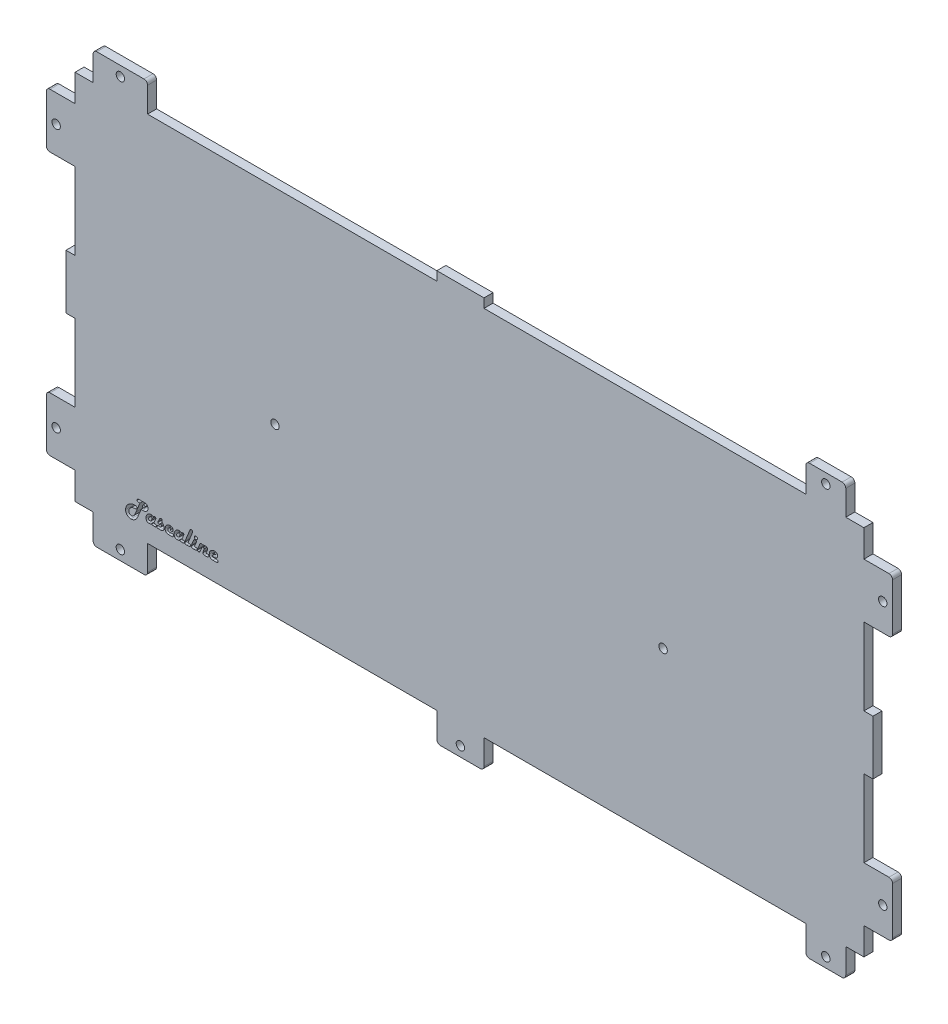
from build123d import *

# Parameters (mm, degrees)
SKETCH1_W                 = 276.225
SKETCH1_H                 = 130.175
BOSS_EXTRUDE1_DEPTH       = 3.175
SKETCH2_W                 = 16.51
SKETCH2_H                 = 3.175
SKETCH2_W_2               = 10.033
SKETCH2_H_2               = 19.05
SKETCH2_W_3               = 3.175
SKETCH2_W_4               = 19.05
SKETCH2_H_3               = 10.033
SKETCH2_W_5               = 13.97
BOSS_EXTRUDE2_DEPTH       = 3.175
F_4_CLEARANCE_HOLE1_D     = 2.9464
F_4_CLEARANCE_HOLE1_DEPTH = 3.302
FILLET1_R                 = 1.27
CUT_EXTRUDE1_DEPTH        = 319.76638225


with BuildPart() as part:
    # Sketch1 → Boss-Extrude1 (new body)
    with BuildSketch(Plane.XY):
        with Locations((138.1125, 65.0875)):
            Rectangle(SKETCH1_W, SKETCH1_H)
    extrude(amount=BOSS_EXTRUDE1_DEPTH)

    # Sketch2 → Boss-Extrude2 (add)
    with BuildSketch(Plane.XY):
        with Locations((134.9375, 131.7625)):
            Rectangle(SKETCH2_W, SKETCH2_H)
        with Locations((281.2415, 19.05)):
            Rectangle(SKETCH2_W_2, SKETCH2_H_2)
        with Locations((281.2415, 111.125)):
            Rectangle(SKETCH2_W_2, SKETCH2_H_2)
        with Locations((277.8125, 65.0875)):
            Rectangle(SKETCH2_W_3, SKETCH2_H_2)
        with Locations((-5.0165, 19.05)):
            Rectangle(SKETCH2_W_2, SKETCH2_H_2)
        with Locations((-1.5875, 65.0875)):
            Rectangle(SKETCH2_W_3, SKETCH2_H_2)
        with Locations((-5.0165, 111.125)):
            Rectangle(SKETCH2_W_2, SKETCH2_H_2)
        with Locations((15.875, -5.0165)):
            Rectangle(SKETCH2_W_4, SKETCH2_H_3)
        with Locations((134.9375, -5.0165)):
            Rectangle(SKETCH2_W, SKETCH2_H_3)
        with Locations((262.89, -5.0165)):
            Rectangle(SKETCH2_W_5, SKETCH2_H_3)
        with Locations((15.875, 135.1915)):
            Rectangle(SKETCH2_W_4, SKETCH2_H_3)
        with Locations((262.89, 135.1915)):
            Rectangle(SKETCH2_W_5, SKETCH2_H_3)
    extrude(amount=BOSS_EXTRUDE2_DEPTH)

    # 4 Clearance Hole1
    with Locations(Plane.XY.offset(3.175)):
        with Locations((70.013924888, 58.42), (205.903924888, 58.42), (134.9375, -6.604), (15.875, -6.604), (262.89, -6.604), (262.89, 136.779), (15.875, 136.779), (282.829, 111.125), (282.829, 19.05), (-6.604, 111.125), (-6.604, 19.05)):
            Hole(F_4_CLEARANCE_HOLE1_D / 2, depth=F_4_CLEARANCE_HOLE1_DEPTH)

    # Fillet1
    fillet1_edges = [part.edges().sort_by_distance(p)[0] for p in [
        (6.35, 140.208, 1.5875),
        (25.4, 140.208, 1.5875),
        (255.905, 140.208, 1.5875),
        (269.875, 140.208, 1.5875),
        (269.875, -10.033, 1.5875),
        (255.905, -10.033, 1.5875),
        (143.1925, -10.033, 1.5875),
        (126.6825, -10.033, 1.5875),
        (25.4, -10.033, 1.5875),
        (6.35, -10.033, 1.5875),
        (-10.033, 120.65, 1.5875),
        (-10.033, 28.575, 1.5875),
        (-10.033, 101.6, 1.5875),
        (-10.033, 9.525, 1.5875),
        (286.258, 120.65, 1.5875),
        (286.258, 101.6, 1.5875),
        (286.258, 28.575, 1.5875),
        (286.258, 9.525, 1.5875),
    ]]
    fillet(fillet1_edges, radius=FILLET1_R)

    # Sketch6 → Cut-Extrude1 (cut, through all)
    # profile 1 of 10: a face of its own
    with BuildSketch(Plane.XY.offset(3.175)):
        with BuildLine():
            Line((23.119201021, 9.164609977), (22.451206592, 7.500566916))
            add(Edge.make_bspline(
                [(22.451206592, 7.500566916), (22.411003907, 7.401430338), (22.333829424, 7.211124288), (22.219435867, 6.938643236), (22.112680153, 6.690113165), (22.012786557, 6.465475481), (21.920717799, 6.264069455), (21.833533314, 6.087517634), (21.755963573, 5.933870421), (21.661354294, 5.762755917), (21.539114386, 5.572432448), (21.375027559, 5.364837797), (21.194459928, 5.172753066), (21.060129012, 5.059889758), (20.992791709, 5.003313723)],
                knots=[0, 0, 0, 0, 1.315970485, 2.526183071, 3.635244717, 4.643279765, 5.550454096, 6.359128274, 7.065363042, 7.667512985, 8.763908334, 9.843272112, 10.918877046, 12, 12, 12, 12], degree=3))
            add(Edge.make_bspline(
                [(20.992791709, 5.003313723), (20.941866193, 4.965231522), (20.841070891, 4.889856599), (20.680401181, 4.792052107), (20.514563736, 4.708473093), (20.341573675, 4.641675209), (20.163005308, 4.589417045), (19.978244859, 4.551262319), (19.787353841, 4.528037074), (19.658056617, 4.52556047), (19.592618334, 4.524307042)],
                knots=[0, 0, 0, 0, 1.011044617, 2.001129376, 2.987597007, 3.961339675, 4.946518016, 5.943976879, 6.959431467, 8, 8, 8, 8], degree=3))
            add(Edge.make_bspline(
                [(19.592618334, 4.524307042), (19.523985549, 4.52577862), (19.389812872, 4.52865546), (19.193870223, 4.554855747), (19.007122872, 4.594062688), (18.83078106, 4.653339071), (18.663334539, 4.726507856), (18.506601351, 4.817898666), (18.35966799, 4.925082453), (18.22480845, 5.048815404), (18.102569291, 5.184697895), (17.996369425, 5.332046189), (17.904994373, 5.488467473), (17.831448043, 5.655681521), (17.774055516, 5.832504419), (17.734367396, 6.018966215), (17.708307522, 6.214954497), (17.70541107, 6.3491208), (17.70392946, 6.417750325)],
                knots=[0, 0, 0, 0, 1.095039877, 2.140732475, 3.150521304, 4.13652018, 5.104897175, 6.062745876, 7.026672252, 8.00261995, 8.979018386, 9.939223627, 10.897072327, 11.865449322, 12.849478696, 13.859267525, 14.904960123, 16, 16, 16, 16], degree=3))
            add(Edge.make_bspline(
                [(17.70392946, 6.417750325), (17.706469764, 6.510196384), (17.711485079, 6.692712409), (17.750571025, 6.961954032), (17.814671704, 7.222484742), (17.905671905, 7.473969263), (18.021297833, 7.716830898), (18.16431112, 7.949570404), (18.332042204, 8.17426002), (18.460931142, 8.313119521), (18.526442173, 8.383698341)],
                knots=[0, 0, 0, 0, 1.01377589, 2.001495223, 2.977585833, 3.952291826, 4.930103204, 5.92294397, 6.944284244, 8, 8, 8, 8], degree=3))
            add(Edge.make_bspline(
                [(18.526442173, 8.383698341), (18.564038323, 8.421013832), (18.639923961, 8.496332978), (18.762383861, 8.601213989), (18.891389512, 8.701406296), (19.026342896, 8.796968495), (19.169837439, 8.884085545), (19.318539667, 8.968473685), (19.475608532, 9.044630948), (19.690708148, 9.141268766), (19.965425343, 9.241006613), (20.2978387, 9.328678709), (20.629749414, 9.381793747), (20.850767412, 9.389158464), (20.96069945, 9.392821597)],
                knots=[0, 0, 0, 0, 0.706155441, 1.425333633, 2.148189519, 2.883981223, 3.628821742, 4.385725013, 5.163077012, 5.955384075, 7.529784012, 9.053423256, 10.534403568, 12, 12, 12, 12], degree=3))
            add(Edge.make_bspline(
                [(20.96069945, 9.392821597), (21.010777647, 9.391629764), (21.10661754, 9.389348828), (21.242284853, 9.36101028), (21.363435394, 9.317754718), (21.467338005, 9.255678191), (21.552788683, 9.180085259), (21.616087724, 9.091135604), (21.653226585, 8.989078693), (21.657440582, 8.917283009), (21.659597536, 8.880534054)],
                knots=[0, 0, 0, 0, 1.238826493, 2.370872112, 3.417595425, 4.41258701, 5.350953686, 6.225146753, 7.091533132, 8, 8, 8, 8], degree=3))
            add(Edge.make_bspline(
                [(21.659597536, 8.880534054), (21.657158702, 8.841764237), (21.65240403, 8.766179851), (21.612518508, 8.658791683), (21.545055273, 8.564566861), (21.48423124, 8.515858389), (21.452780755, 8.490672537)],
                knots=[0, 0, 0, 0, 1.010937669, 1.970891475, 2.950802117, 4, 4, 4, 4], degree=3))
            add(Edge.make_bspline(
                [(21.452780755, 8.490672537), (21.428650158, 8.476261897), (21.374303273, 8.443806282), (21.271172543, 8.413087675), (21.142728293, 8.387298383), (21.04721528, 8.377274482), (20.995168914, 8.371812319)],
                knots=[0, 0, 0, 0, 0.704559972, 1.586808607, 2.68501851, 4, 4, 4, 4], degree=3))
            add(Edge.make_bspline(
                [(20.995168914, 8.371812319), (20.930899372, 8.36533971), (20.80556437, 8.352717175), (20.622961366, 8.323144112), (20.44919412, 8.289935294), (20.285218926, 8.246571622), (20.130183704, 8.19766871), (19.983692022, 8.144126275), (19.847574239, 8.080489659), (19.761927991, 8.032764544), (19.719798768, 8.009288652)],
                knots=[0, 0, 0, 0, 1.159710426, 2.261604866, 3.320677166, 4.335395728, 5.305245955, 6.239579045, 7.134052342, 8, 8, 8, 8], degree=3))
            add(Edge.make_bspline(
                [(19.719798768, 8.009288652), (19.654419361, 7.967339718), (19.52562533, 7.884702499), (19.354426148, 7.733222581), (19.203332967, 7.564964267), (19.075629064, 7.379109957), (18.973627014, 7.181271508), (18.89879096, 6.976254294), (18.852926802, 6.765270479), (18.847636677, 6.622412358), (18.844987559, 6.550873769)],
                knots=[0, 0, 0, 0, 1.047576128, 2.063670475, 3.075290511, 4.094745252, 5.099666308, 6.072755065, 7.034899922, 8, 8, 8, 8], degree=3))
            add(Edge.make_bspline(
                [(18.844987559, 6.550873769), (18.845636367, 6.515185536), (18.846908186, 6.445228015), (18.857899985, 6.343133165), (18.875018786, 6.246246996), (18.901788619, 6.15588907), (18.933862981, 6.070634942), (18.972695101, 5.990387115), (19.020918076, 5.917086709), (19.073977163, 5.848438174), (19.13513267, 5.788442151), (19.199905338, 5.73415304), (19.271326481, 5.690354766), (19.346543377, 5.652700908), (19.427352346, 5.624580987), (19.513023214, 5.604540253), (19.603256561, 5.590584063), (19.665464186, 5.589730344), (19.697215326, 5.589294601)],
                knots=[0, 0, 0, 0, 1.180906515, 2.314860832, 3.395146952, 4.432720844, 5.428859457, 6.408284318, 7.375873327, 8.328235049, 9.274073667, 10.205991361, 11.119268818, 12.040047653, 12.985704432, 13.943108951, 14.9501506, 16, 16, 16, 16], degree=3))
            add(Edge.make_bspline(
                [(19.697215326, 5.589294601), (19.73772721, 5.590178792), (19.817696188, 5.591924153), (19.934736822, 5.613557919), (20.047745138, 5.64535598), (20.156538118, 5.691126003), (20.261491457, 5.749525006), (20.361851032, 5.821430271), (20.457232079, 5.906838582), (20.550130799, 6.005691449), (20.640514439, 6.122252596), (20.735291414, 6.255321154), (20.829339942, 6.410668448), (20.926497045, 6.585296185), (21.026287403, 6.779583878), (21.128874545, 6.99369617), (21.231187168, 7.22917089), (21.299659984, 7.393110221), (21.335109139, 7.477983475)],
                knots=[0, 0, 0, 0, 0.731682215, 1.444313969, 2.14503258, 2.851587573, 3.573238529, 4.31284086, 5.079201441, 5.885132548, 6.76239785, 7.744387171, 8.838039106, 10.04403949, 11.357848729, 12.787140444, 14.336666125, 16, 16, 16, 16], degree=3))
            Line((21.335109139, 7.477983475), (22.730528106, 10.914232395))
            Line((22.730528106, 10.914232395), (22.293122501, 10.914232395))
            add(Edge.make_bspline(
                [(22.293122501, 10.914232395), (22.249482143, 10.915318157), (22.167784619, 10.917350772), (22.053469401, 10.933486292), (21.955911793, 10.96103767), (21.875553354, 11.001448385), (21.812083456, 11.0538411), (21.766552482, 11.118910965), (21.739607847, 11.196317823), (21.737016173, 11.251577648), (21.735668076, 11.280321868)],
                knots=[0, 0, 0, 0, 1.386647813, 2.595892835, 3.659749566, 4.594681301, 5.434731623, 6.248703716, 7.089037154, 8, 8, 8, 8], degree=3))
            add(Edge.make_bspline(
                [(21.735668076, 11.280321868), (21.737604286, 11.321461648), (21.741339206, 11.400819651), (21.780099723, 11.512122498), (21.841922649, 11.609323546), (21.930694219, 11.688476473), (22.040352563, 11.751577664), (22.17060237, 11.796320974), (22.320267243, 11.821779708), (22.426142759, 11.825246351), (22.482110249, 11.827078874)],
                knots=[0, 0, 0, 0, 0.942601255, 1.818263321, 2.674766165, 3.564433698, 4.523656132, 5.566505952, 6.713616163, 8, 8, 8, 8], degree=3))
            Line((22.482110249, 11.827078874), (24.009464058, 11.827078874))
            add(Edge.make_bspline(
                [(24.009464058, 11.827078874), (24.07248493, 11.826141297), (24.194705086, 11.824322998), (24.371659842, 11.811086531), (24.536158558, 11.790426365), (24.687661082, 11.7598162), (24.826003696, 11.719494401), (24.951704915, 11.670604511), (25.065549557, 11.614116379), (25.166457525, 11.546868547), (25.254881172, 11.47075861), (25.331318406, 11.384834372), (25.394973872, 11.289168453), (25.449869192, 11.185035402), (25.489653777, 11.069843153), (25.51766631, 10.945418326), (25.536143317, 10.81176616), (25.53815736, 10.719365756), (25.539195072, 10.671757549)],
                knots=[0, 0, 0, 0, 1.377685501, 2.671828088, 3.877302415, 5.000186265, 6.047243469, 7.023626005, 7.94558449, 8.820055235, 9.667510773, 10.489711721, 11.325757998, 12.174186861, 13.056345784, 13.980864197, 14.959664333, 16, 16, 16, 16], degree=3))
            add(Edge.make_bspline(
                [(25.539195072, 10.671757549), (25.537217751, 10.613032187), (25.533336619, 10.497764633), (25.507219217, 10.328808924), (25.461558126, 10.168586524), (25.398541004, 10.016101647), (25.315426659, 9.873155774), (25.215734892, 9.73744145), (25.098243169, 9.609536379), (25.007634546, 9.534438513), (24.961534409, 9.496229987)],
                knots=[0, 0, 0, 0, 1.037190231, 2.03582197, 3.010506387, 3.973515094, 4.942177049, 5.923321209, 6.943420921, 8, 8, 8, 8], degree=3))
            add(Edge.make_bspline(
                [(24.961534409, 9.496229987), (24.924861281, 9.469591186), (24.849567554, 9.414898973), (24.722279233, 9.347795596), (24.581294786, 9.290628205), (24.42582274, 9.24494617), (24.257052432, 9.208122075), (24.073914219, 9.182358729), (23.876613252, 9.166850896), (23.740077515, 9.16537344), (23.669523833, 9.164609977)],
                knots=[0, 0, 0, 0, 0.800437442, 1.643380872, 2.535600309, 3.486195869, 4.50417187, 5.586788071, 6.752993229, 8, 8, 8, 8], degree=3))
            Line((23.669523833, 9.164609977), (23.119201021, 9.164609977))
        make_face()
        with BuildLine():
            Line((23.509062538, 10.077456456), (23.833550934, 10.077456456))
            add(Edge.make_bspline(
                [(23.833550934, 10.077456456), (23.883581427, 10.078871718), (23.978009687, 10.081542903), (24.109812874, 10.105830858), (24.222265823, 10.147368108), (24.315221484, 10.206091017), (24.38842248, 10.283422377), (24.437974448, 10.379084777), (24.470358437, 10.489814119), (24.47287967, 10.569284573), (24.474207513, 10.611138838)],
                knots=[0, 0, 0, 0, 1.258971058, 2.376199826, 3.358208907, 4.260347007, 5.121448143, 6.005251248, 6.949436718, 8, 8, 8, 8], degree=3))
            add(Edge.make_bspline(
                [(24.474207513, 10.611138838), (24.473067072, 10.634992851), (24.470906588, 10.680182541), (24.45485612, 10.743618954), (24.424912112, 10.796445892), (24.384765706, 10.841296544), (24.331090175, 10.873849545), (24.267531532, 10.898068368), (24.192697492, 10.911946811), (24.139079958, 10.913437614), (24.110495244, 10.914232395)],
                knots=[0, 0, 0, 0, 1.057975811, 2.004258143, 2.869579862, 3.727735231, 4.644179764, 5.623179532, 6.73286349, 8, 8, 8, 8], degree=3))
            Line((24.110495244, 10.914232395), (23.84187115, 10.914232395))
            Line((23.84187115, 10.914232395), (23.509062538, 10.077456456))
        make_face(mode=Mode.SUBTRACT)
    # profile 2 of 10: a face of its own
    with BuildSketch(Plane.XY.offset(3.175)):
        with BuildLine():
            Line((27.590722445, 7.262846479), (28.032882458, 7.262846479))
            add(Edge.make_bspline(
                [(28.032882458, 7.262846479), (28.069771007, 7.26168404), (28.139217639, 7.259495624), (28.237100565, 7.244044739), (28.319497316, 7.213913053), (28.389453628, 7.175207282), (28.441730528, 7.120759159), (28.479643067, 7.055670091), (28.502815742, 6.978700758), (28.504866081, 6.923472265), (28.505946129, 6.894379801)],
                knots=[0, 0, 0, 0, 1.294214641, 2.436497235, 3.45633191, 4.35958604, 5.214514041, 6.067746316, 6.982155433, 8, 8, 8, 8], degree=3))
            add(Edge.make_bspline(
                [(28.505946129, 6.894379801), (28.504075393, 6.853751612), (28.500488, 6.775841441), (28.467922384, 6.66547908), (28.411237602, 6.570686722), (28.335484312, 6.489620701), (28.239850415, 6.426705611), (28.127852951, 6.380604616), (27.999107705, 6.355527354), (27.90818237, 6.351900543), (27.860535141, 6.35)],
                knots=[0, 0, 0, 0, 1.02006706, 1.956119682, 2.85821293, 3.77438774, 4.72208319, 5.713685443, 6.801912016, 8, 8, 8, 8], degree=3))
            Line((27.860535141, 6.35), (27.347058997, 6.35))
            add(Edge.make_bspline(
                [(27.347058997, 6.35), (27.319272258, 6.350924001), (27.266140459, 6.35269081), (27.189661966, 6.365809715), (27.119931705, 6.388489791), (27.056725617, 6.420297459), (27.001086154, 6.461923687), (26.951568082, 6.511009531), (26.909321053, 6.570088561), (26.888358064, 6.614676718), (26.877561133, 6.637641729)],
                knots=[0, 0, 0, 0, 1.135602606, 2.17141737, 3.159933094, 4.123316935, 5.049777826, 5.988893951, 6.964185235, 8, 8, 8, 8], degree=3))
            add(Edge.make_bspline(
                [(26.877561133, 6.637641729), (26.829418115, 6.593791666), (26.738706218, 6.511168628), (26.589078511, 6.421916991), (26.442765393, 6.360717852), (26.343224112, 6.353490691), (26.295146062, 6.35)],
                knots=[0, 0, 0, 0, 1.172355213, 2.208971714, 3.134940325, 4, 4, 4, 4], degree=3))
            Line((26.295146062, 6.35), (25.838722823, 6.35))
            add(Edge.make_bspline(
                [(25.838722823, 6.35), (25.802613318, 6.350846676), (25.732080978, 6.352500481), (25.629021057, 6.36739538), (25.530996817, 6.390336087), (25.439134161, 6.425910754), (25.351766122, 6.468220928), (25.269891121, 6.521254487), (25.194345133, 6.584489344), (25.123714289, 6.655720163), (25.061392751, 6.735720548), (25.004824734, 6.82093039), (24.958631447, 6.913392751), (24.9203783, 7.011259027), (24.891018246, 7.114802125), (24.869013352, 7.224008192), (24.857836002, 7.339477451), (24.855668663, 7.418533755), (24.854560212, 7.45896584)],
                knots=[0, 0, 0, 0, 1.038881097, 2.029236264, 2.991883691, 3.930308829, 4.858629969, 5.782385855, 6.730121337, 7.689859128, 8.664191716, 9.644845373, 10.629272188, 11.633194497, 12.665607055, 13.723595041, 14.835769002, 16, 16, 16, 16], degree=3))
            add(Edge.make_bspline(
                [(24.854560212, 7.45896584), (24.85610135, 7.520862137), (24.859147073, 7.643186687), (24.885247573, 7.824235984), (24.926425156, 8.000246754), (24.985151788, 8.171403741), (25.060821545, 8.33685869), (25.150817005, 8.498507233), (25.260719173, 8.653277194), (25.383466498, 8.802278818), (25.517065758, 8.939411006), (25.65634466, 9.060947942), (25.801550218, 9.162226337), (25.949498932, 9.247803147), (26.103529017, 9.312208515), (26.26118757, 9.359174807), (26.423717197, 9.387067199), (26.533554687, 9.390897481), (26.588730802, 9.392821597)],
                knots=[0, 0, 0, 0, 1.038393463, 2.052158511, 3.063456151, 4.068635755, 5.08344709, 6.113632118, 7.168837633, 8.264602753, 9.350863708, 10.378663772, 11.361961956, 12.31789787, 13.241700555, 14.156967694, 15.07416527, 16, 16, 16, 16], degree=3))
            add(Edge.make_bspline(
                [(26.588730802, 9.392821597), (26.629955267, 9.391802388), (26.709847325, 9.389827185), (26.825936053, 9.377663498), (26.93284671, 9.352720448), (27.032648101, 9.323430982), (27.12225627, 9.280706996), (27.204008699, 9.230733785), (27.277694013, 9.171469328), (27.318416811, 9.124076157), (27.338738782, 9.100425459)],
                knots=[0, 0, 0, 0, 1.187749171, 2.30183041, 3.353985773, 4.346587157, 5.291117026, 6.203238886, 7.103359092, 8, 8, 8, 8], degree=3))
            add(Edge.make_bspline(
                [(27.338738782, 9.100425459), (27.355674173, 9.123800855), (27.388572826, 9.169209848), (27.444893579, 9.229036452), (27.505129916, 9.279630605), (27.568893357, 9.321936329), (27.638154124, 9.352158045), (27.709275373, 9.377183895), (27.78560771, 9.389834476), (27.837518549, 9.391809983), (27.864100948, 9.392821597)],
                knots=[0, 0, 0, 0, 1.102961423, 2.142610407, 3.131917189, 4.106850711, 5.056016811, 6.014208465, 6.983119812, 8, 8, 8, 8], degree=3))
            add(Edge.make_bspline(
                [(27.864100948, 9.392821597), (27.892332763, 9.391374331), (27.947568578, 9.388542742), (28.026788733, 9.368747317), (28.097661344, 9.332619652), (28.159912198, 9.285477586), (28.212990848, 9.22913499), (28.25007614, 9.163329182), (28.274365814, 9.091402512), (28.276592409, 9.040801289), (28.277734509, 9.014846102)],
                knots=[0, 0, 0, 0, 1.085152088, 2.123110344, 3.11068521, 4.121931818, 5.11360817, 6.061884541, 7.005870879, 8, 8, 8, 8], degree=3))
            add(Edge.make_bspline(
                [(28.277734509, 9.014846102), (28.277038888, 8.995776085), (28.275563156, 8.955319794), (28.262690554, 8.892397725), (28.242496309, 8.824341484), (28.223506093, 8.778549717), (28.213549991, 8.754542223)],
                knots=[0, 0, 0, 0, 0.847236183, 1.797378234, 2.845219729, 4, 4, 4, 4], degree=3))
            Line((28.213549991, 8.754542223), (28.16957171, 8.648756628))
            Line((28.16957171, 8.648756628), (27.590722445, 7.262846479))
        make_face()
        with BuildLine():
            Line((26.134684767, 7.262846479), (26.235715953, 7.262846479))
            add(Edge.make_bspline(
                [(26.235715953, 7.262846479), (26.261118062, 7.263403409), (26.310245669, 7.264480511), (26.380704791, 7.276313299), (26.444219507, 7.296625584), (26.501442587, 7.324150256), (26.551533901, 7.360081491), (26.595304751, 7.403527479), (26.631459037, 7.455722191), (26.649532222, 7.494711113), (26.658858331, 7.514830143)],
                knots=[0, 0, 0, 0, 1.157664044, 2.238919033, 3.244614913, 4.190073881, 5.122668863, 6.042574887, 6.989931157, 8, 8, 8, 8], degree=3))
            Line((26.658858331, 7.514830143), (26.92985963, 8.166184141))
            add(Edge.make_bspline(
                [(26.92985963, 8.166184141), (26.946051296, 8.204845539), (26.974847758, 8.27360384), (26.981585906, 8.347699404), (26.98453533, 8.380132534)],
                knots=[0, 0, 0, 0, 1.124559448, 2, 2, 2, 2], degree=3))
            add(Edge.make_bspline(
                [(26.98453533, 8.380132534), (26.982919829, 8.396510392), (26.979660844, 8.429549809), (26.960273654, 8.478036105), (26.923140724, 8.519372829), (26.877468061, 8.558290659), (26.822149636, 8.591249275), (26.759781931, 8.614843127), (26.692035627, 8.629673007), (26.645070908, 8.631284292), (26.620823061, 8.632116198)],
                knots=[0, 0, 0, 0, 0.81058345, 1.635208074, 2.524363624, 3.523748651, 4.593951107, 5.683817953, 6.804157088, 8, 8, 8, 8], degree=3))
            add(Edge.make_bspline(
                [(26.620823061, 8.632116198), (26.596174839, 8.63128371), (26.546394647, 8.629602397), (26.472572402, 8.613117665), (26.399545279, 8.588130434), (26.327079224, 8.552743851), (26.255132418, 8.507577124), (26.183183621, 8.452598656), (26.113420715, 8.386315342), (26.021876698, 8.289084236), (25.923002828, 8.158030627), (25.834330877, 7.992365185), (25.778103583, 7.822683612), (25.770947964, 7.707389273), (25.767406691, 7.650330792)],
                knots=[0, 0, 0, 0, 0.627706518, 1.267732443, 1.919531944, 2.592823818, 3.31892668, 4.082778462, 4.897707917, 5.769757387, 7.487317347, 9.064628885, 10.547302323, 12, 12, 12, 12], degree=3))
            add(Edge.make_bspline(
                [(25.767406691, 7.650330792), (25.768547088, 7.620143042), (25.770712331, 7.562826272), (25.786711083, 7.482537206), (25.814989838, 7.413874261), (25.857126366, 7.358291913), (25.910530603, 7.314821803), (25.97542406, 7.283164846), (26.051786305, 7.265877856), (26.106072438, 7.263892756), (26.134684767, 7.262846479)],
                knots=[0, 0, 0, 0, 1.183693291, 2.247450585, 3.194323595, 4.070859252, 4.954393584, 5.871857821, 6.878330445, 8, 8, 8, 8], degree=3))
        make_face(mode=Mode.SUBTRACT)
    # profile 3 of 10: a face of its own
    with BuildSketch(Plane.XY.offset(3.175)):
        with BuildLine():
            Line((29.990510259, 8.330211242), (29.912062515, 8.16024113))
            add(Edge.make_bspline(
                [(29.912062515, 8.16024113), (29.896884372, 8.131312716), (29.86769618, 8.07568219), (29.814544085, 8.00141012), (29.757815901, 7.937540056), (29.695046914, 7.885850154), (29.628129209, 7.844607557), (29.555769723, 7.815808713), (29.478606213, 7.79887687), (29.425612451, 7.796534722), (29.39858637, 7.795340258)],
                knots=[0, 0, 0, 0, 1.174117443, 2.257875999, 3.277186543, 4.239058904, 5.172954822, 6.09414408, 7.028039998, 8, 8, 8, 8], degree=3))
            add(Edge.make_bspline(
                [(29.39858637, 7.795340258), (29.371134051, 7.796795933), (29.316667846, 7.799684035), (29.237096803, 7.82031378), (29.16263589, 7.855638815), (29.09462143, 7.902428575), (29.037107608, 7.958103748), (28.993789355, 8.019877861), (28.967174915, 8.086882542), (28.963967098, 8.133470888), (28.962369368, 8.156675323)],
                knots=[0, 0, 0, 0, 1.057292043, 2.097698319, 3.142574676, 4.21811325, 5.26521749, 6.20945791, 7.108177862, 8, 8, 8, 8], degree=3))
            add(Edge.make_bspline(
                [(28.962369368, 8.156675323), (28.963902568, 8.18098518), (28.967274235, 8.234445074), (28.992789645, 8.318434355), (29.027799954, 8.414397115), (29.061029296, 8.47951667), (29.078852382, 8.514444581)],
                knots=[0, 0, 0, 0, 0.768398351, 1.68978755, 2.760880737, 4, 4, 4, 4], degree=3))
            Line((29.078852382, 8.514444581), (29.612534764, 9.55209429))
            add(Edge.make_bspline(
                [(29.612534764, 9.55209429), (29.628998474, 9.581760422), (29.660355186, 9.638262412), (29.714608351, 9.714353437), (29.771846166, 9.778597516), (29.830813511, 9.833390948), (29.894697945, 9.874194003), (29.961322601, 9.90314064), (30.030689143, 9.921974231), (30.078349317, 9.92419981), (30.102238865, 9.925315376)],
                knots=[0, 0, 0, 0, 1.254889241, 2.390056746, 3.44940031, 4.435704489, 5.358962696, 6.23882182, 7.117213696, 8, 8, 8, 8], degree=3))
            add(Edge.make_bspline(
                [(30.102238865, 9.925315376), (30.127723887, 9.924333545), (30.177477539, 9.922416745), (30.249027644, 9.902648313), (30.314253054, 9.870016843), (30.371649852, 9.82561983), (30.422350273, 9.775108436), (30.456581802, 9.715249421), (30.480139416, 9.651678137), (30.482550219, 9.606987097), (30.483780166, 9.584186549)],
                knots=[0, 0, 0, 0, 1.076175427, 2.100985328, 3.113101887, 4.142426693, 5.162150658, 6.116677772, 7.039163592, 8, 8, 8, 8], degree=3))
            add(Edge.make_bspline(
                [(30.483780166, 9.584186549), (30.483189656, 9.576625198), (30.481707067, 9.55764097), (30.472108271, 9.524410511), (30.457923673, 9.48041725), (30.445526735, 9.447837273), (30.438613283, 9.429668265)],
                knots=[0, 0, 0, 0, 0.562304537, 1.411773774, 2.556613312, 4, 4, 4, 4], degree=3))
            add(Edge.make_bspline(
                [(30.438613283, 9.429668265), (30.429934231, 9.4021552), (30.4139082, 9.351351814), (30.409658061, 9.29828798), (30.407709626, 9.273961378)],
                knots=[0, 0, 0, 0, 1.083119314, 2, 2, 2, 2], degree=3))
            add(Edge.make_bspline(
                [(30.407709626, 9.273961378), (30.410360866, 9.231672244), (30.41576673, 9.145444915), (30.457407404, 9.016624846), (30.521341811, 8.886134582), (30.581783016, 8.805145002), (30.613337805, 8.762862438)],
                knots=[0, 0, 0, 0, 0.903479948, 1.84219102, 2.873463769, 4, 4, 4, 4], degree=3))
            Line((30.613337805, 8.762862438), (30.862944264, 8.449071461))
            add(Edge.make_bspline(
                [(30.862944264, 8.449071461), (30.89315876, 8.40941273), (30.95181765, 8.332418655), (31.029517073, 8.213642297), (31.096639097, 8.096689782), (31.150204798, 7.979553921), (31.192582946, 7.863611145), (31.222000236, 7.748525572), (31.241056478, 7.634323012), (31.243346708, 7.558484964), (31.244485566, 7.520773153)],
                knots=[0, 0, 0, 0, 1.169686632, 2.270847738, 3.328397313, 4.331060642, 5.289870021, 6.221237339, 7.115478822, 8, 8, 8, 8], degree=3))
            add(Edge.make_bspline(
                [(31.244485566, 7.520773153), (31.243374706, 7.479898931), (31.241185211, 7.399336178), (31.222953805, 7.281348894), (31.193158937, 7.168541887), (31.151222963, 7.060930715), (31.097710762, 6.958280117), (31.031457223, 6.861340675), (30.953690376, 6.769443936), (30.865170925, 6.683679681), (30.768195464, 6.604874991), (30.663003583, 6.537900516), (30.55370701, 6.478341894), (30.437152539, 6.432662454), (30.315721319, 6.395108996), (30.188203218, 6.369932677), (30.055210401, 6.351843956), (29.964426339, 6.35062387), (29.918005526, 6.35)],
                knots=[0, 0, 0, 0, 0.993241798, 1.957671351, 2.894532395, 3.824635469, 4.759513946, 5.702543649, 6.673110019, 7.681185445, 8.695042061, 9.70491044, 10.708882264, 11.715852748, 12.742665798, 13.794825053, 14.872423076, 16, 16, 16, 16], degree=3))
            Line((29.918005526, 6.35), (29.080040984, 6.35))
            add(Edge.make_bspline(
                [(29.080040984, 6.35), (29.041166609, 6.351148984), (28.968164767, 6.353306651), (28.865667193, 6.368799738), (28.778850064, 6.39860707), (28.70672086, 6.439016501), (28.649687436, 6.491477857), (28.609138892, 6.556610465), (28.58673032, 6.634252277), (28.583643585, 6.689400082), (28.582016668, 6.718466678)],
                knots=[0, 0, 0, 0, 1.323532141, 2.485449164, 3.513452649, 4.431917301, 5.281225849, 6.123328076, 7.010867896, 8, 8, 8, 8], degree=3))
            add(Edge.make_bspline(
                [(28.582016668, 6.718466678), (28.583766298, 6.759131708), (28.587126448, 6.837228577), (28.621444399, 6.947402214), (28.678777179, 7.042559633), (28.758030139, 7.122462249), (28.857096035, 7.185049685), (28.972704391, 7.232327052), (29.105937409, 7.257322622), (29.199599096, 7.26094353), (29.248822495, 7.262846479)],
                knots=[0, 0, 0, 0, 1.001377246, 1.923137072, 2.813709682, 3.719614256, 4.674449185, 5.687788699, 6.784829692, 8, 8, 8, 8], degree=3))
            Line((29.248822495, 7.262846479), (29.71356595, 7.262846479))
            add(Edge.make_bspline(
                [(29.71356595, 7.262846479), (29.761976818, 7.263714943), (29.852890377, 7.265345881), (29.979460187, 7.28416678), (30.087169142, 7.314282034), (30.176102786, 7.356875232), (30.246912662, 7.412505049), (30.297305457, 7.482368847), (30.326991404, 7.565690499), (30.330040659, 7.625120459), (30.331639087, 7.656273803)],
                knots=[0, 0, 0, 0, 1.402558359, 2.633945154, 3.698995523, 4.63394819, 5.475307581, 6.281836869, 7.099334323, 8, 8, 8, 8], degree=3))
            add(Edge.make_bspline(
                [(30.331639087, 7.656273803), (30.329759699, 7.681390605), (30.325750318, 7.734973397), (30.29981842, 7.817251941), (30.260510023, 7.906123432), (30.223911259, 7.964172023), (30.204458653, 7.995025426)],
                knots=[0, 0, 0, 0, 0.822745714, 1.755200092, 2.806866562, 4, 4, 4, 4], degree=3))
            Line((30.204458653, 7.995025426), (29.990510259, 8.330211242))
        make_face()
    # profile 4 of 10: a face of its own
    with BuildSketch(Plane.XY.offset(3.175)):
        with BuildLine():
            Line((33.843958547, 6.35), (32.680317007, 6.35))
            add(Edge.make_bspline(
                [(32.680317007, 6.35), (32.639473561, 6.351331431), (32.559475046, 6.353939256), (32.442122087, 6.368805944), (32.331089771, 6.397249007), (32.224677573, 6.432858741), (32.125228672, 6.482977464), (32.031435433, 6.542005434), (31.943344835, 6.612135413), (31.862148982, 6.692296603), (31.788904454, 6.781373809), (31.723642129, 6.876673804), (31.67087138, 6.979950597), (31.624984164, 7.087986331), (31.590247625, 7.203147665), (31.567630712, 7.324780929), (31.550914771, 7.452170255), (31.549492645, 7.539336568), (31.548767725, 7.583769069)],
                knots=[0, 0, 0, 0, 1.04308008, 2.043041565, 3.012085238, 3.965374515, 4.901770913, 5.84746328, 6.790555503, 7.770466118, 8.754752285, 9.731054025, 10.712842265, 11.710345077, 12.724731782, 13.776116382, 14.86638876, 16, 16, 16, 16], degree=3))
            add(Edge.make_bspline(
                [(31.548767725, 7.583769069), (31.550434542, 7.643669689), (31.553726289, 7.761965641), (31.577855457, 7.936444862), (31.618616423, 8.105181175), (31.675046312, 8.268099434), (31.750410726, 8.42377383), (31.839361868, 8.574392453), (31.946140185, 8.718148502), (32.065971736, 8.855189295), (32.19833574, 8.979735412), (32.336825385, 9.090917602), (32.481896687, 9.184309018), (32.632077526, 9.261377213), (32.789231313, 9.319248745), (32.951349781, 9.362816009), (33.119703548, 9.388030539), (33.233728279, 9.391214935), (33.29125853, 9.392821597)],
                knots=[0, 0, 0, 0, 1.033018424, 2.040077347, 3.031267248, 4.023304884, 5.007568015, 6.009629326, 7.036117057, 8.091719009, 9.145549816, 10.16692925, 11.15074152, 12.116516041, 13.072326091, 14.033738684, 15.007938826, 16, 16, 16, 16], degree=3))
            add(Edge.make_bspline(
                [(33.29125853, 9.392821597), (33.330123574, 9.39229061), (33.406065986, 9.391253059), (33.516835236, 9.378681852), (33.62234278, 9.360223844), (33.721984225, 9.332564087), (33.816684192, 9.298575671), (33.904919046, 9.254933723), (33.988753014, 9.205465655), (34.065535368, 9.147041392), (34.135215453, 9.083436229), (34.197063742, 9.015218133), (34.248354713, 8.941154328), (34.289538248, 8.862143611), (34.324343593, 8.779529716), (34.345526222, 8.691155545), (34.361010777, 8.598583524), (34.362575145, 8.535117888), (34.363377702, 8.502558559)],
                knots=[0, 0, 0, 0, 1.192851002, 2.330834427, 3.419016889, 4.478598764, 5.502444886, 6.503631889, 7.49680333, 8.487139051, 9.460210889, 10.390750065, 11.308717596, 12.217610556, 13.123567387, 14.053072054, 15.001181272, 16, 16, 16, 16], degree=3))
            add(Edge.make_bspline(
                [(34.363377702, 8.502558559), (34.361783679, 8.458384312), (34.358716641, 8.37338923), (34.328641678, 8.252278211), (34.283123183, 8.141976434), (34.216010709, 8.047284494), (34.135293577, 7.969033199), (34.041830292, 7.91161127), (33.936681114, 7.87676091), (33.862847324, 7.873225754), (33.824940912, 7.871410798)],
                knots=[0, 0, 0, 0, 1.140049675, 2.193554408, 3.207776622, 4.208142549, 5.171800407, 6.095933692, 7.022448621, 8, 8, 8, 8], degree=3))
            add(Edge.make_bspline(
                [(33.824940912, 7.871410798), (33.795542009, 7.87215502), (33.740311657, 7.873553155), (33.663568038, 7.888085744), (33.597715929, 7.909794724), (33.543778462, 7.942790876), (33.500419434, 7.984790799), (33.471820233, 8.038507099), (33.453420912, 8.100004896), (33.451523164, 8.144247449), (33.450531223, 8.167372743)],
                knots=[0, 0, 0, 0, 1.293872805, 2.430738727, 3.43019671, 4.33150824, 5.195698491, 6.055468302, 6.983605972, 8, 8, 8, 8], degree=3))
            add(Edge.make_bspline(
                [(33.450531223, 8.167372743), (33.450531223, 8.181239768), (33.450531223, 8.206596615), (33.450531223, 8.231953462), (33.450531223, 8.243443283)],
                knots=[0, 0, 0, 0, 1.09375, 2, 2, 2, 2], degree=3))
            add(Edge.make_bspline(
                [(33.450531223, 8.243443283), (33.450531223, 8.255725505), (33.450531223, 8.279497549), (33.450531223, 8.303269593), (33.450531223, 8.314759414)],
                knots=[0, 0, 0, 0, 1.033333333, 2, 2, 2, 2], degree=3))
            add(Edge.make_bspline(
                [(33.450531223, 8.314759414), (33.44967953, 8.333876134), (33.448077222, 8.369840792), (33.434613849, 8.419916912), (33.413511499, 8.463087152), (33.380914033, 8.497551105), (33.339478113, 8.523737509), (33.289753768, 8.542520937), (33.231618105, 8.554749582), (33.189901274, 8.555594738), (33.167643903, 8.556045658)],
                knots=[0, 0, 0, 0, 1.076936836, 2.026062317, 2.906040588, 3.760364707, 4.665822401, 5.649858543, 6.746118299, 8, 8, 8, 8], degree=3))
            add(Edge.make_bspline(
                [(33.167643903, 8.556045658), (33.123621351, 8.553163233), (33.034942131, 8.547356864), (32.906677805, 8.495910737), (32.786484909, 8.413771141), (32.676556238, 8.304885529), (32.583034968, 8.177699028), (32.511892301, 8.039385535), (32.470278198, 7.891609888), (32.464516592, 7.790439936), (32.461614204, 7.739475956)],
                knots=[0, 0, 0, 0, 0.889989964, 1.79279967, 2.759962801, 3.828151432, 4.914528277, 5.949409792, 6.967022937, 8, 8, 8, 8], degree=3))
            add(Edge.make_bspline(
                [(32.461614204, 7.739475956), (32.463855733, 7.699247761), (32.468094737, 7.623171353), (32.500732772, 7.517048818), (32.560782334, 7.431656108), (32.643809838, 7.363978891), (32.755272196, 7.317078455), (32.894754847, 7.2858988), (33.064490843, 7.266324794), (33.187790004, 7.264066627), (33.254411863, 7.262846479)],
                knots=[0, 0, 0, 0, 0.913027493, 1.726645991, 2.482782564, 3.249916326, 4.127695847, 5.201188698, 6.487726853, 8, 8, 8, 8], degree=3))
            Line((33.254411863, 7.262846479), (34.012740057, 7.262846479))
            add(Edge.make_bspline(
                [(34.012740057, 7.262846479), (34.052054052, 7.261906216), (34.125991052, 7.260137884), (34.229054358, 7.242045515), (34.317391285, 7.214818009), (34.390470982, 7.173472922), (34.447565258, 7.119330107), (34.488145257, 7.052929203), (34.510965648, 6.974664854), (34.513940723, 6.919099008), (34.515518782, 6.889625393)],
                knots=[0, 0, 0, 0, 1.322009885, 2.486276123, 3.511116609, 4.419281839, 5.287086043, 6.131096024, 7.008683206, 8, 8, 8, 8], degree=3))
            add(Edge.make_bspline(
                [(34.515518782, 6.889625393), (34.513867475, 6.849711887), (34.510676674, 6.772587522), (34.474586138, 6.664416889), (34.416987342, 6.569236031), (34.336227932, 6.489587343), (34.236195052, 6.426608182), (34.119790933, 6.380845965), (33.986884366, 6.355420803), (33.893195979, 6.351867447), (33.843958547, 6.35)],
                knots=[0, 0, 0, 0, 0.982987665, 1.899414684, 2.782606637, 3.710260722, 4.674394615, 5.685217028, 6.783478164, 8, 8, 8, 8], degree=3))
        make_face()
    # profile 5 of 10: a face of its own
    with BuildSketch(Plane.XY.offset(3.175)):
        with BuildLine():
            Line((37.403822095, 7.262846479), (37.845982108, 7.262846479))
            add(Edge.make_bspline(
                [(37.845982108, 7.262846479), (37.882870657, 7.26168404), (37.952317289, 7.259495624), (38.050200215, 7.244044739), (38.132596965, 7.213913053), (38.202553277, 7.175207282), (38.254830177, 7.120759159), (38.292742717, 7.055670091), (38.315915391, 6.978700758), (38.31796573, 6.923472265), (38.319045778, 6.894379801)],
                knots=[0, 0, 0, 0, 1.294214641, 2.436497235, 3.45633191, 4.35958604, 5.214514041, 6.067746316, 6.982155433, 8, 8, 8, 8], degree=3))
            add(Edge.make_bspline(
                [(38.319045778, 6.894379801), (38.317175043, 6.853751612), (38.313587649, 6.775841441), (38.281022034, 6.66547908), (38.224337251, 6.570686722), (38.148583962, 6.489620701), (38.052950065, 6.426705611), (37.9409526, 6.380604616), (37.812207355, 6.355527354), (37.721282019, 6.351900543), (37.673634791, 6.35)],
                knots=[0, 0, 0, 0, 1.02006706, 1.956119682, 2.85821293, 3.77438774, 4.72208319, 5.713685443, 6.801912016, 8, 8, 8, 8], degree=3))
            Line((37.673634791, 6.35), (37.160158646, 6.35))
            add(Edge.make_bspline(
                [(37.160158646, 6.35), (37.132371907, 6.350924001), (37.079240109, 6.35269081), (37.002761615, 6.365809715), (36.933031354, 6.388489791), (36.869825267, 6.420297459), (36.814185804, 6.461923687), (36.764667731, 6.511009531), (36.722420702, 6.570088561), (36.701457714, 6.614676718), (36.690660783, 6.637641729)],
                knots=[0, 0, 0, 0, 1.135602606, 2.17141737, 3.159933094, 4.123316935, 5.049777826, 5.988893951, 6.964185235, 8, 8, 8, 8], degree=3))
            add(Edge.make_bspline(
                [(36.690660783, 6.637641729), (36.642517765, 6.593791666), (36.551805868, 6.511168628), (36.402178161, 6.421916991), (36.255865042, 6.360717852), (36.156323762, 6.353490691), (36.108245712, 6.35)],
                knots=[0, 0, 0, 0, 1.172355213, 2.208971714, 3.134940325, 4, 4, 4, 4], degree=3))
            Line((36.108245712, 6.35), (35.651822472, 6.35))
            add(Edge.make_bspline(
                [(35.651822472, 6.35), (35.615712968, 6.350846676), (35.545180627, 6.352500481), (35.442120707, 6.36739538), (35.344096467, 6.390336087), (35.252233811, 6.425910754), (35.164865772, 6.468220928), (35.082990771, 6.521254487), (35.007444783, 6.584489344), (34.936813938, 6.655720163), (34.8744924, 6.735720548), (34.817924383, 6.82093039), (34.771731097, 6.913392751), (34.733477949, 7.011259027), (34.704117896, 7.114802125), (34.682113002, 7.224008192), (34.670935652, 7.339477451), (34.668768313, 7.418533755), (34.667659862, 7.45896584)],
                knots=[0, 0, 0, 0, 1.038881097, 2.029236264, 2.991883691, 3.930308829, 4.858629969, 5.782385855, 6.730121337, 7.689859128, 8.664191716, 9.644845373, 10.629272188, 11.633194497, 12.665607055, 13.723595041, 14.835769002, 16, 16, 16, 16], degree=3))
            add(Edge.make_bspline(
                [(34.667659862, 7.45896584), (34.669201, 7.520862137), (34.672246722, 7.643186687), (34.698347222, 7.824235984), (34.739524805, 8.000246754), (34.798251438, 8.171403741), (34.873921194, 8.33685869), (34.963916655, 8.498507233), (35.073818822, 8.653277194), (35.196566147, 8.802278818), (35.330165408, 8.939411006), (35.46944431, 9.060947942), (35.614649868, 9.162226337), (35.762598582, 9.247803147), (35.916628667, 9.312208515), (36.07428722, 9.359174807), (36.236816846, 9.387067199), (36.346654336, 9.390897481), (36.401830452, 9.392821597)],
                knots=[0, 0, 0, 0, 1.038393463, 2.052158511, 3.063456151, 4.068635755, 5.08344709, 6.113632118, 7.168837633, 8.264602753, 9.350863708, 10.378663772, 11.361961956, 12.31789787, 13.241700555, 14.156967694, 15.07416527, 16, 16, 16, 16], degree=3))
            add(Edge.make_bspline(
                [(36.401830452, 9.392821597), (36.443054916, 9.391802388), (36.522946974, 9.389827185), (36.639035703, 9.377663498), (36.74594636, 9.352720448), (36.845747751, 9.323430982), (36.935355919, 9.280706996), (37.017108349, 9.230733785), (37.090793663, 9.171469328), (37.131516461, 9.124076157), (37.151838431, 9.100425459)],
                knots=[0, 0, 0, 0, 1.187749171, 2.30183041, 3.353985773, 4.346587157, 5.291117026, 6.203238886, 7.103359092, 8, 8, 8, 8], degree=3))
            add(Edge.make_bspline(
                [(37.151838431, 9.100425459), (37.168773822, 9.123800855), (37.201672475, 9.169209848), (37.257993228, 9.229036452), (37.318229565, 9.279630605), (37.381993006, 9.321936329), (37.451253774, 9.352158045), (37.522375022, 9.377183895), (37.598707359, 9.389834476), (37.650618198, 9.391809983), (37.677200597, 9.392821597)],
                knots=[0, 0, 0, 0, 1.102961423, 2.142610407, 3.131917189, 4.106850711, 5.056016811, 6.014208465, 6.983119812, 8, 8, 8, 8], degree=3))
            add(Edge.make_bspline(
                [(37.677200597, 9.392821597), (37.705432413, 9.391374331), (37.760668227, 9.388542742), (37.839888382, 9.368747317), (37.910760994, 9.332619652), (37.973011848, 9.285477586), (38.026090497, 9.22913499), (38.06317579, 9.163329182), (38.087465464, 9.091402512), (38.089692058, 9.040801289), (38.090834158, 9.014846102)],
                knots=[0, 0, 0, 0, 1.085152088, 2.123110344, 3.11068521, 4.121931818, 5.11360817, 6.061884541, 7.005870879, 8, 8, 8, 8], degree=3))
            add(Edge.make_bspline(
                [(38.090834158, 9.014846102), (38.090138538, 8.995776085), (38.088662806, 8.955319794), (38.075790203, 8.892397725), (38.055595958, 8.824341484), (38.036605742, 8.778549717), (38.02664964, 8.754542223)],
                knots=[0, 0, 0, 0, 0.847236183, 1.797378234, 2.845219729, 4, 4, 4, 4], degree=3))
            Line((38.02664964, 8.754542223), (37.982671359, 8.648756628))
            Line((37.982671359, 8.648756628), (37.403822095, 7.262846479))
        make_face()
        with BuildLine():
            Line((35.947784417, 7.262846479), (36.048815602, 7.262846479))
            add(Edge.make_bspline(
                [(36.048815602, 7.262846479), (36.074217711, 7.263403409), (36.123345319, 7.264480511), (36.19380444, 7.276313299), (36.257319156, 7.296625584), (36.314542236, 7.324150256), (36.364633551, 7.360081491), (36.4084044, 7.403527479), (36.444558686, 7.455722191), (36.462631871, 7.494711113), (36.471957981, 7.514830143)],
                knots=[0, 0, 0, 0, 1.157664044, 2.238919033, 3.244614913, 4.190073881, 5.122668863, 6.042574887, 6.989931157, 8, 8, 8, 8], degree=3))
            Line((36.471957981, 7.514830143), (36.742959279, 8.166184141))
            add(Edge.make_bspline(
                [(36.742959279, 8.166184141), (36.759150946, 8.204845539), (36.787947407, 8.27360384), (36.794685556, 8.347699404), (36.79763498, 8.380132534)],
                knots=[0, 0, 0, 0, 1.124559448, 2, 2, 2, 2], degree=3))
            add(Edge.make_bspline(
                [(36.79763498, 8.380132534), (36.796019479, 8.396510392), (36.792760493, 8.429549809), (36.773373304, 8.478036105), (36.736240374, 8.519372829), (36.69056771, 8.558290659), (36.635249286, 8.591249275), (36.572881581, 8.614843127), (36.505135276, 8.629673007), (36.458170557, 8.631284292), (36.433922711, 8.632116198)],
                knots=[0, 0, 0, 0, 0.81058345, 1.635208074, 2.524363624, 3.523748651, 4.593951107, 5.683817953, 6.804157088, 8, 8, 8, 8], degree=3))
            add(Edge.make_bspline(
                [(36.433922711, 8.632116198), (36.409274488, 8.63128371), (36.359494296, 8.629602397), (36.285672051, 8.613117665), (36.212644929, 8.588130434), (36.140178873, 8.552743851), (36.068232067, 8.507577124), (35.99628327, 8.452598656), (35.926520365, 8.386315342), (35.834976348, 8.289084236), (35.736102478, 8.158030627), (35.647430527, 7.992365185), (35.591203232, 7.822683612), (35.584047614, 7.707389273), (35.580506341, 7.650330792)],
                knots=[0, 0, 0, 0, 0.627706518, 1.267732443, 1.919531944, 2.592823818, 3.31892668, 4.082778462, 4.897707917, 5.769757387, 7.487317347, 9.064628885, 10.547302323, 12, 12, 12, 12], degree=3))
            add(Edge.make_bspline(
                [(35.580506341, 7.650330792), (35.581646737, 7.620143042), (35.58381198, 7.562826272), (35.599810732, 7.482537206), (35.628089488, 7.413874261), (35.670226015, 7.358291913), (35.723630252, 7.314821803), (35.788523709, 7.283164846), (35.864885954, 7.265877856), (35.919172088, 7.263892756), (35.947784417, 7.262846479)],
                knots=[0, 0, 0, 0, 1.183693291, 2.247450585, 3.194323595, 4.070859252, 4.954393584, 5.871857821, 6.878330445, 8, 8, 8, 8], degree=3))
        make_face(mode=Mode.SUBTRACT)
    # profile 6 of 10: a face of its own
    with BuildSketch(Plane.XY.offset(3.175)):
        with BuildLine():
            Line((39.54330603, 7.262846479), (39.964071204, 7.262846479))
            add(Edge.make_bspline(
                [(39.964071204, 7.262846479), (40.002196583, 7.261905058), (40.073773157, 7.260137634), (40.173354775, 7.242145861), (40.258430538, 7.21455385), (40.328942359, 7.173454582), (40.383609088, 7.11886309), (40.42260496, 7.052624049), (40.445990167, 6.974752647), (40.447970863, 6.919118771), (40.449020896, 6.889625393)],
                knots=[0, 0, 0, 0, 1.309452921, 2.458366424, 3.466370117, 4.370442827, 5.237320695, 6.092345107, 6.988688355, 8, 8, 8, 8], degree=3))
            add(Edge.make_bspline(
                [(40.449020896, 6.889625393), (40.447172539, 6.849379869), (40.443628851, 6.772220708), (40.410674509, 6.662826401), (40.354637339, 6.568445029), (40.278306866, 6.487978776), (40.181022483, 6.426596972), (40.067670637, 6.380781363), (39.936642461, 6.355345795), (39.844129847, 6.351847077), (39.795289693, 6.35)],
                knots=[0, 0, 0, 0, 1.005849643, 1.928425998, 2.826684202, 3.731762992, 4.678240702, 5.683992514, 6.777310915, 8, 8, 8, 8], degree=3))
            Line((39.795289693, 6.35), (39.073808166, 6.35))
            add(Edge.make_bspline(
                [(39.073808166, 6.35), (39.024104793, 6.3511204), (38.929397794, 6.353255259), (38.796033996, 6.382209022), (38.676940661, 6.423380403), (38.576584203, 6.485782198), (38.495272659, 6.562202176), (38.435788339, 6.652638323), (38.402076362, 6.756603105), (38.397478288, 6.829563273), (38.395116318, 6.867041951)],
                knots=[0, 0, 0, 0, 1.241664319, 2.36592195, 3.401368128, 4.381172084, 5.300106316, 6.174896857, 7.062468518, 8, 8, 8, 8], degree=3))
            add(Edge.make_bspline(
                [(38.395116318, 6.867041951), (38.396820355, 6.891314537), (38.400783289, 6.947763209), (38.426103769, 7.040904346), (38.463269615, 7.154591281), (38.495268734, 7.23606788), (38.512787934, 7.280675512)],
                knots=[0, 0, 0, 0, 0.674710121, 1.569115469, 2.669114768, 4, 4, 4, 4], degree=3))
            Line((38.512787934, 7.280675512), (40.156624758, 11.269624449))
            Line((40.156624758, 11.269624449), (40.200603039, 11.377787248))
            add(Edge.make_bspline(
                [(40.200603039, 11.377787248), (40.216217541, 11.413587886), (40.246179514, 11.482284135), (40.305952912, 11.573107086), (40.370159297, 11.65166252), (40.441516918, 11.716981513), (40.521220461, 11.766228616), (40.607611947, 11.801209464), (40.700702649, 11.823225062), (40.765462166, 11.825777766), (40.798469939, 11.827078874)],
                knots=[0, 0, 0, 0, 1.172057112, 2.249008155, 3.255426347, 4.216793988, 5.142151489, 6.055552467, 7.008919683, 8, 8, 8, 8], degree=3))
            add(Edge.make_bspline(
                [(40.798469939, 11.827078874), (40.825920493, 11.825652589), (40.879616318, 11.822862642), (40.957619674, 11.802461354), (41.028264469, 11.765925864), (41.090955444, 11.717396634), (41.142843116, 11.659734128), (41.182670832, 11.595411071), (41.205959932, 11.523955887), (41.208462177, 11.474226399), (41.209726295, 11.449103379)],
                knots=[0, 0, 0, 0, 1.062046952, 2.077462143, 3.092414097, 4.119914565, 5.129756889, 6.079111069, 7.029579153, 8, 8, 8, 8], degree=3))
            add(Edge.make_bspline(
                [(41.209726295, 11.449103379), (41.20909523, 11.428441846), (41.207786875, 11.385605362), (41.194478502, 11.319713), (41.175877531, 11.249663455), (41.158246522, 11.202532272), (41.149107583, 11.17810208)],
                knots=[0, 0, 0, 0, 0.886930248, 1.83882642, 2.879767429, 4, 4, 4, 4], degree=3))
            Line((41.149107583, 11.17810208), (41.105129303, 11.071127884))
            Line((41.105129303, 11.071127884), (39.54330603, 7.262846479))
        make_face()
    # profile 7 of 10: a face of its own
    with BuildSketch(Plane.XY.offset(3.175)):
        with BuildLine():
            Line((41.789764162, 7.262846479), (42.242621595, 7.262846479))
            add(Edge.make_bspline(
                [(42.242621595, 7.262846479), (42.280736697, 7.261862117), (42.352684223, 7.260003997), (42.452770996, 7.242389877), (42.538364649, 7.214203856), (42.609688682, 7.173848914), (42.66461192, 7.11885279), (42.703227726, 7.052418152), (42.728514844, 6.974996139), (42.730229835, 6.919162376), (42.731137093, 6.889625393)],
                knots=[0, 0, 0, 0, 1.304697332, 2.462796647, 3.467139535, 4.379611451, 5.243341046, 6.095260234, 6.992361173, 8, 8, 8, 8], degree=3))
            add(Edge.make_bspline(
                [(42.731137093, 6.889625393), (42.729430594, 6.849332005), (42.726153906, 6.77196377), (42.691223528, 6.663102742), (42.635735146, 6.567968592), (42.557990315, 6.488402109), (42.460572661, 6.426230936), (42.345779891, 6.38066451), (42.213189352, 6.355453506), (42.119508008, 6.351878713), (42.070274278, 6.35)],
                knots=[0, 0, 0, 0, 0.999806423, 1.919750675, 2.812612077, 3.719089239, 4.659880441, 5.668737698, 6.77481754, 8, 8, 8, 8], degree=3))
            Line((42.070274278, 6.35), (41.431994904, 6.35))
            add(Edge.make_bspline(
                [(41.431994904, 6.35), (41.376431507, 6.351856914), (41.270967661, 6.355381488), (41.121241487, 6.380775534), (40.990465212, 6.4260805), (40.877888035, 6.48709218), (40.788242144, 6.56634996), (40.723001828, 6.659858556), (40.684553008, 6.767566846), (40.679725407, 6.843357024), (40.677232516, 6.882493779)],
                knots=[0, 0, 0, 0, 1.286858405, 2.442561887, 3.501884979, 4.479685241, 5.389631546, 6.247460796, 7.095018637, 8, 8, 8, 8], degree=3))
            add(Edge.make_bspline(
                [(40.677232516, 6.882493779), (40.67872995, 6.905923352), (40.681953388, 6.956358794), (40.697945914, 7.036256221), (40.726401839, 7.124356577), (40.750186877, 7.185320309), (40.762811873, 7.217679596)],
                knots=[0, 0, 0, 0, 0.809405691, 1.742359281, 2.801653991, 4, 4, 4, 4], degree=3))
            Line((40.762811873, 7.217679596), (41.43556071, 8.831801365))
            Line((41.43556071, 8.831801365), (41.479538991, 8.94352997))
            add(Edge.make_bspline(
                [(41.479538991, 8.94352997), (41.495767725, 8.979199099), (41.526754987, 9.047305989), (41.584545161, 9.139675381), (41.65045709, 9.216928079), (41.721708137, 9.2831716), (41.802633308, 9.331930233), (41.890127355, 9.366968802), (41.984410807, 9.388962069), (42.049947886, 9.391518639), (42.083348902, 9.392821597)],
                knots=[0, 0, 0, 0, 1.169726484, 2.233484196, 3.241125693, 4.19639886, 5.12596356, 6.044540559, 7.003398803, 8, 8, 8, 8], degree=3))
            add(Edge.make_bspline(
                [(42.083348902, 9.392821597), (42.111217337, 9.391464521), (42.165352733, 9.388828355), (42.24365817, 9.367717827), (42.315487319, 9.333117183), (42.379270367, 9.28518985), (42.433485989, 9.229524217), (42.474563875, 9.166557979), (42.497800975, 9.09643038), (42.501195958, 9.047892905), (42.502925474, 9.023166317)],
                knots=[0, 0, 0, 0, 1.079075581, 2.096141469, 3.119681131, 4.151827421, 5.172944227, 6.118867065, 7.04168896, 8, 8, 8, 8], degree=3))
            add(Edge.make_bspline(
                [(42.502925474, 9.023166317), (42.501208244, 8.999685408), (42.497285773, 8.946050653), (42.473384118, 8.858863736), (42.439230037, 8.754470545), (42.407349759, 8.681382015), (42.390008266, 8.641625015)],
                knots=[0, 0, 0, 0, 0.704844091, 1.609994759, 2.699940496, 4, 4, 4, 4], degree=3))
            Line((42.390008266, 8.641625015), (41.789764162, 7.262846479))
        make_face()
    # profile 8 of 10: a face of its own
    with BuildSketch(Plane.XY.offset(3.175)):
        with BuildLine():
            add(Edge.make_bspline(
                [(42.312749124, 10.686020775), (42.35098851, 10.683948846), (42.425999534, 10.679884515), (42.534063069, 10.648189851), (42.632081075, 10.594152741), (42.719488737, 10.52223134), (42.791410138, 10.434823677), (42.845447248, 10.336805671), (42.877141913, 10.228742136), (42.881206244, 10.153731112), (42.883278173, 10.115491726)],
                knots=[0, 0, 0, 0, 1.022434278, 2.00562427, 2.98307932, 4, 5.01692068, 5.99437573, 6.977565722, 8, 8, 8, 8], degree=3))
            add(Edge.make_bspline(
                [(42.883278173, 10.115491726), (42.881206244, 10.07725234), (42.877141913, 10.002241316), (42.845447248, 9.89417778), (42.791410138, 9.796159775), (42.719488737, 9.708752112), (42.632081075, 9.636830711), (42.534063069, 9.582793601), (42.425999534, 9.551098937), (42.35098851, 9.547034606), (42.312749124, 9.544962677)],
                knots=[0, 0, 0, 0, 1.022434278, 2.00562427, 2.98307932, 4, 5.01692068, 5.99437573, 6.977565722, 8, 8, 8, 8], degree=3))
            add(Edge.make_bspline(
                [(42.312749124, 9.544962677), (42.274509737, 9.547034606), (42.199498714, 9.551098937), (42.091435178, 9.582793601), (41.993417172, 9.636830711), (41.90600951, 9.708752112), (41.834088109, 9.796159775), (41.780050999, 9.89417778), (41.748356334, 10.002241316), (41.744292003, 10.07725234), (41.742220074, 10.115491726)],
                knots=[0, 0, 0, 0, 1.022434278, 2.00562427, 2.98307932, 4, 5.01692068, 5.99437573, 6.977565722, 8, 8, 8, 8], degree=3))
            add(Edge.make_bspline(
                [(41.742220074, 10.115491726), (41.744292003, 10.153731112), (41.748356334, 10.228742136), (41.780050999, 10.336805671), (41.834088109, 10.434823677), (41.90600951, 10.52223134), (41.993417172, 10.594152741), (42.091435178, 10.648189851), (42.199498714, 10.679884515), (42.274509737, 10.683948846), (42.312749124, 10.686020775)],
                knots=[0, 0, 0, 0, 1.022434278, 2.00562427, 2.98307932, 4, 5.01692068, 5.99437573, 6.977565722, 8, 8, 8, 8], degree=3))
        make_face()
    # profile 9 of 10: a face of its own
    with BuildSketch(Plane.XY.offset(3.175)):
        with BuildLine():
            Line((45.852406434, 7.262846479), (46.33379032, 7.262846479))
            add(Edge.make_bspline(
                [(46.33379032, 7.262846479), (46.3734953, 7.26191626), (46.447818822, 7.260174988), (46.551356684, 7.242145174), (46.639762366, 7.214405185), (46.713691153, 7.174246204), (46.769847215, 7.118882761), (46.810128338, 7.052775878), (46.834785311, 6.974892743), (46.837506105, 6.919137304), (46.838946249, 6.889625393)],
                knots=[0, 0, 0, 0, 1.332122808, 2.493592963, 3.515972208, 4.433507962, 5.28966748, 6.131650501, 7.011063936, 8, 8, 8, 8], degree=3))
            add(Edge.make_bspline(
                [(46.838946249, 6.889625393), (46.837352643, 6.849299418), (46.834287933, 6.771747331), (46.797691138, 6.663020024), (46.741108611, 6.567530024), (46.660689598, 6.487937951), (46.560413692, 6.426872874), (46.443757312, 6.380359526), (46.309453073, 6.355613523), (46.214624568, 6.351928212), (46.165008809, 6.35)],
                knots=[0, 0, 0, 0, 0.989273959, 1.902502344, 2.790953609, 3.701572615, 4.657126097, 5.664420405, 6.777988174, 8, 8, 8, 8], degree=3))
            Line((46.165008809, 6.35), (45.327044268, 6.35))
            add(Edge.make_bspline(
                [(45.327044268, 6.35), (45.290017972, 6.351788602), (45.218062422, 6.355264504), (45.115045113, 6.383438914), (45.021633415, 6.429678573), (44.938761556, 6.492035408), (44.870663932, 6.56933659), (44.821280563, 6.657675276), (44.789552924, 6.75557435), (44.786577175, 6.824397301), (44.785041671, 6.859910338)],
                knots=[0, 0, 0, 0, 1.06919643, 2.077837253, 3.061385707, 4.06709547, 5.057357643, 6.016388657, 6.97644519, 8, 8, 8, 8], degree=3))
            add(Edge.make_bspline(
                [(44.785041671, 6.859910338), (44.7863485, 6.884961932), (44.789281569, 6.941188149), (44.811132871, 7.032534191), (44.839982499, 7.141270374), (44.867587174, 7.217876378), (44.88250705, 7.259280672)],
                knots=[0, 0, 0, 0, 0.728058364, 1.634066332, 2.72125148, 4, 4, 4, 4], degree=3))
            Line((44.88250705, 7.259280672), (45.189166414, 8.112697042))
            add(Edge.make_bspline(
                [(45.189166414, 8.112697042), (45.203665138, 8.152690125), (45.22913537, 8.222946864), (45.237752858, 8.297086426), (45.241464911, 8.32902264)],
                knots=[0, 0, 0, 0, 1.138483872, 2, 2, 2, 2], degree=3))
            add(Edge.make_bspline(
                [(45.241464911, 8.32902264), (45.240977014, 8.344172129), (45.240019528, 8.373902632), (45.226232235, 8.417527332), (45.200746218, 8.457190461), (45.164170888, 8.490732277), (45.12233102, 8.521335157), (45.071890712, 8.540771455), (45.016812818, 8.55494658), (44.977699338, 8.555670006), (44.957388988, 8.556045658)],
                knots=[0, 0, 0, 0, 0.891014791, 1.748594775, 2.662913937, 3.638243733, 4.662752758, 5.700245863, 6.805812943, 8, 8, 8, 8], degree=3))
            add(Edge.make_bspline(
                [(44.957388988, 8.556045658), (44.924326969, 8.554116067), (44.85826004, 8.550260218), (44.761877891, 8.522057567), (44.670966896, 8.474398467), (44.586303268, 8.407461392), (44.505747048, 8.323434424), (44.43304525, 8.219273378), (44.361783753, 8.099183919), (44.322868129, 8.009791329), (44.302469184, 7.962933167)],
                knots=[0, 0, 0, 0, 0.844704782, 1.68795045, 2.544298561, 3.454102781, 4.435689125, 5.509683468, 6.694616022, 8, 8, 8, 8], degree=3))
            Line((44.302469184, 7.962933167), (43.836537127, 6.855155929))
            add(Edge.make_bspline(
                [(43.836537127, 6.855155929), (43.8187913, 6.815093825), (43.784904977, 6.738593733), (43.722361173, 6.63547109), (43.654630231, 6.547193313), (43.579529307, 6.475044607), (43.497198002, 6.418936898), (43.408174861, 6.379574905), (43.312895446, 6.35478057), (43.247141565, 6.351611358), (43.213709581, 6.35)],
                knots=[0, 0, 0, 0, 1.228540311, 2.345943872, 3.375718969, 4.343035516, 5.255843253, 6.156722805, 7.062801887, 8, 8, 8, 8], degree=3))
            add(Edge.make_bspline(
                [(43.213709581, 6.35), (43.186253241, 6.350961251), (43.132999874, 6.352825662), (43.056330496, 6.37257492), (42.986617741, 6.405369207), (42.924012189, 6.448465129), (42.872180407, 6.502064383), (42.835177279, 6.563553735), (42.810672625, 6.630709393), (42.808376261, 6.677840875), (42.807207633, 6.701826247)],
                knots=[0, 0, 0, 0, 1.09983931, 2.133210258, 3.150310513, 4.177917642, 5.167433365, 6.116266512, 7.041361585, 8, 8, 8, 8], degree=3))
            add(Edge.make_bspline(
                [(42.807207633, 6.701826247), (42.807775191, 6.720923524), (42.808981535, 6.76151481), (42.82417858, 6.823910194), (42.84213012, 6.892898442), (42.861268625, 6.938956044), (42.871392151, 6.963318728)],
                knots=[0, 0, 0, 0, 0.84408435, 1.794102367, 2.833165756, 4, 4, 4, 4], degree=3))
            Line((42.871392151, 6.963318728), (42.915370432, 7.069104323))
            Line((42.915370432, 7.069104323), (43.722431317, 9.013657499))
            add(Edge.make_bspline(
                [(43.722431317, 9.013657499), (43.736024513, 9.043705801), (43.762174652, 9.101511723), (43.810788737, 9.179819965), (43.867823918, 9.245088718), (43.931099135, 9.299456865), (44.002307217, 9.341662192), (44.080331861, 9.371242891), (44.164921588, 9.389742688), (44.223526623, 9.391774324), (44.253736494, 9.392821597)],
                knots=[0, 0, 0, 0, 1.133500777, 2.180591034, 3.155994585, 4.103301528, 5.037982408, 5.986855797, 6.962259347, 8, 8, 8, 8], degree=3))
            add(Edge.make_bspline(
                [(44.253736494, 9.392821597), (44.278378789, 9.392405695), (44.326457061, 9.391594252), (44.395334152, 9.377530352), (44.459894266, 9.357992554), (44.517905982, 9.327638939), (44.571276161, 9.290693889), (44.618320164, 9.24428565), (44.659875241, 9.189780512), (44.68216389, 9.148695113), (44.693519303, 9.127763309)],
                knots=[0, 0, 0, 0, 1.084507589, 2.115925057, 3.08838965, 4.049487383, 4.989875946, 5.941237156, 6.951120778, 8, 8, 8, 8], degree=3))
            add(Edge.make_bspline(
                [(44.693519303, 9.127763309), (44.76345287, 9.168604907), (44.897850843, 9.247094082), (45.10806668, 9.328351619), (45.312009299, 9.38273803), (45.447566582, 9.389516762), (45.513654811, 9.392821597)],
                knots=[0, 0, 0, 0, 1.112280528, 2.137575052, 3.092012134, 4, 4, 4, 4], degree=3))
            add(Edge.make_bspline(
                [(45.513654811, 9.392821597), (45.574092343, 9.390414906), (45.690709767, 9.385771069), (45.857457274, 9.347168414), (46.007883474, 9.2825976), (46.137922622, 9.191681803), (46.247310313, 9.084115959), (46.325460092, 8.957722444), (46.374461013, 8.817470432), (46.379791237, 8.718498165), (46.382523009, 8.667774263)],
                knots=[0, 0, 0, 0, 1.147170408, 2.213526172, 3.231603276, 4.238037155, 5.212112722, 6.124927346, 7.039013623, 8, 8, 8, 8], degree=3))
            add(Edge.make_bspline(
                [(46.382523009, 8.667774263), (46.381235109, 8.637985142), (46.378572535, 8.576399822), (46.360621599, 8.482157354), (46.333927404, 8.383113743), (46.307193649, 8.317674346), (46.293377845, 8.283855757)],
                knots=[0, 0, 0, 0, 0.901170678, 1.863058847, 2.895644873, 4, 4, 4, 4], degree=3))
            Line((46.293377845, 8.283855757), (45.852406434, 7.262846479))
        make_face()
    # profile 10 of 10: a face of its own
    with BuildSketch(Plane.XY.offset(3.175)):
        with BuildLine():
            add(Edge.make_bspline(
                [(47.950289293, 7.491058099), (47.95152998, 7.472981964), (47.95394454, 7.437803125), (47.977010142, 7.389091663), (48.014503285, 7.348644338), (48.066089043, 7.316871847), (48.130895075, 7.291819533), (48.209490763, 7.275127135), (48.302218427, 7.264433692), (48.368641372, 7.263401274), (48.404335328, 7.262846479)],
                knots=[0, 0, 0, 0, 0.764367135, 1.48757176, 2.238468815, 3.079136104, 4.038989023, 5.178564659, 6.483834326, 8, 8, 8, 8], degree=3))
            Line((48.404335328, 7.262846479), (49.595314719, 7.262846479))
            add(Edge.make_bspline(
                [(49.595314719, 7.262846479), (49.6354148, 7.261898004), (49.710914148, 7.260112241), (49.816380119, 7.242065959), (49.906861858, 7.214654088), (49.982270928, 7.174268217), (50.039531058, 7.118941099), (50.081360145, 7.053124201), (50.105742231, 6.974850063), (50.108512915, 6.919122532), (50.109979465, 6.889625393)],
                knots=[0, 0, 0, 0, 1.329951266, 2.503996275, 3.539647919, 4.458105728, 5.313878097, 6.153119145, 7.022427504, 8, 8, 8, 8], degree=3))
            add(Edge.make_bspline(
                [(50.109979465, 6.889625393), (50.108390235, 6.849295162), (50.105333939, 6.77173489), (50.068678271, 6.663064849), (50.012167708, 6.567120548), (49.930371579, 6.487977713), (49.828765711, 6.426563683), (49.709576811, 6.380245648), (49.571746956, 6.355574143), (49.474166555, 6.351918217), (49.422967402, 6.35)],
                knots=[0, 0, 0, 0, 0.976933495, 1.878770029, 2.756138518, 3.662236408, 4.614048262, 5.626718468, 6.754770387, 8, 8, 8, 8], degree=3))
            Line((49.422967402, 6.35), (48.287852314, 6.35))
            add(Edge.make_bspline(
                [(48.287852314, 6.35), (48.236308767, 6.350834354), (48.136577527, 6.35244874), (47.991592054, 6.367110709), (47.85632986, 6.390213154), (47.730251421, 6.423759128), (47.613495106, 6.466321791), (47.505912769, 6.518290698), (47.408693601, 6.581185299), (47.320067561, 6.652019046), (47.242862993, 6.733971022), (47.173837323, 6.823044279), (47.11848838, 6.923083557), (47.07194765, 7.030566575), (47.034711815, 7.146704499), (47.00913881, 7.271823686), (46.993300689, 7.405861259), (46.991840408, 7.49814318), (46.991087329, 7.545733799)],
                knots=[0, 0, 0, 0, 1.227108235, 2.374322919, 3.466320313, 4.491595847, 5.476620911, 6.421800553, 7.32994879, 8.228786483, 9.116312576, 10.005091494, 10.905017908, 11.830449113, 12.791227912, 13.803396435, 14.867191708, 16, 16, 16, 16], degree=3))
            add(Edge.make_bspline(
                [(46.991087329, 7.545733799), (46.99263616, 7.607625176), (46.995687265, 7.729547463), (47.021387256, 7.909136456), (47.063392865, 8.082025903), (47.119753, 8.249557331), (47.195789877, 8.408958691), (47.286389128, 8.562811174), (47.395623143, 8.708659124), (47.517934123, 8.847885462), (47.651866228, 8.975525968), (47.795131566, 9.085964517), (47.943423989, 9.181178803), (48.098568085, 9.259141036), (48.260764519, 9.318215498), (48.428699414, 9.361332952), (48.602738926, 9.388479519), (48.721196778, 9.391362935), (48.781122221, 9.392821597)],
                knots=[0, 0, 0, 0, 1.040395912, 2.049517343, 3.043324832, 4.029374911, 5.015897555, 6.007693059, 7.027077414, 8.075019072, 9.12126503, 10.132759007, 11.112327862, 12.080685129, 13.046081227, 14.009175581, 14.992881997, 16, 16, 16, 16], degree=3))
            add(Edge.make_bspline(
                [(48.781122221, 9.392821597), (48.824324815, 9.391705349), (48.908910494, 9.389519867), (49.032680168, 9.378412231), (49.14924932, 9.356279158), (49.259827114, 9.328504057), (49.363451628, 9.289927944), (49.461149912, 9.243837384), (49.552125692, 9.189044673), (49.634873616, 9.125511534), (49.711412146, 9.057593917), (49.777115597, 8.981741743), (49.833371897, 8.901050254), (49.878514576, 8.814543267), (49.915054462, 8.723581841), (49.939345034, 8.626382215), (49.955575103, 8.524104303), (49.957075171, 8.453891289), (49.957838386, 8.418167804)],
                knots=[0, 0, 0, 0, 1.207786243, 2.364705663, 3.468027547, 4.520851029, 5.547315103, 6.552779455, 7.536484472, 8.5087175, 9.46512013, 10.391169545, 11.306498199, 12.207991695, 13.112743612, 14.039322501, 15.002432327, 16, 16, 16, 16], degree=3))
            add(Edge.make_bspline(
                [(49.957838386, 8.418167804), (49.956516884, 8.375685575), (49.953930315, 8.292535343), (49.932353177, 8.17214378), (49.896535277, 8.060702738), (49.847230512, 7.957438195), (49.782363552, 7.863126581), (49.703349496, 7.777415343), (49.610559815, 7.699624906), (49.540109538, 7.657686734), (49.50379235, 7.636067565)],
                knots=[0, 0, 0, 0, 1.069179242, 2.092698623, 3.067607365, 4.009120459, 4.963808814, 5.93825802, 6.937169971, 8, 8, 8, 8], degree=3))
            add(Edge.make_bspline(
                [(49.50379235, 7.636067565), (49.481876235, 7.623986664), (49.436531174, 7.598990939), (49.360714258, 7.571965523), (49.27850275, 7.546155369), (49.188021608, 7.527030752), (49.090284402, 7.509403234), (48.984500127, 7.500046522), (48.871178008, 7.492148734), (48.793025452, 7.491429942), (48.752595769, 7.491058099)],
                knots=[0, 0, 0, 0, 0.775768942, 1.605087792, 2.492325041, 3.450334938, 4.473645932, 5.574054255, 6.745015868, 8, 8, 8, 8], degree=3))
            Line((48.752595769, 7.491058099), (47.950289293, 7.491058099))
        make_face()
        with BuildLine():
            Line((48.142842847, 8.251763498), (48.585002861, 8.251763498))
            add(Edge.make_bspline(
                [(48.585002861, 8.251763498), (48.621868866, 8.252097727), (48.69052928, 8.252720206), (48.786093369, 8.260244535), (48.866570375, 8.269749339), (48.932164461, 8.284843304), (48.983201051, 8.30457975), (49.020499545, 8.328442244), (49.043380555, 8.359947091), (49.044458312, 8.382988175), (49.044991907, 8.39439576)],
                knots=[0, 0, 0, 0, 1.705094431, 3.175621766, 4.432939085, 5.451044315, 6.281582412, 6.952824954, 7.481546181, 8, 8, 8, 8], degree=3))
            add(Edge.make_bspline(
                [(49.044991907, 8.39439576), (49.043244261, 8.40721497), (49.039839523, 8.432189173), (49.024074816, 8.467036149), (48.997646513, 8.494487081), (48.964651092, 8.517743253), (48.92329066, 8.535195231), (48.874153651, 8.548286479), (48.816555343, 8.554797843), (48.775587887, 8.555612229), (48.753784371, 8.556045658)],
                knots=[0, 0, 0, 0, 0.838547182, 1.633645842, 2.4358048, 3.286135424, 4.243266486, 5.336598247, 6.582496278, 8, 8, 8, 8], degree=3))
            add(Edge.make_bspline(
                [(48.753784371, 8.556045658), (48.722425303, 8.55517955), (48.660954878, 8.553481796), (48.571248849, 8.538750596), (48.48645603, 8.51540872), (48.406957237, 8.481149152), (48.331909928, 8.439213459), (48.263571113, 8.385065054), (48.198644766, 8.323929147), (48.161645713, 8.276080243), (48.142842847, 8.251763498)],
                knots=[0, 0, 0, 0, 1.059074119, 2.076009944, 3.063613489, 4.023510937, 4.995010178, 5.959100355, 6.962817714, 8, 8, 8, 8], degree=3))
        make_face(mode=Mode.SUBTRACT)
    extrude(amount=-CUT_EXTRUDE1_DEPTH, mode=Mode.SUBTRACT)


with BuildPart() as cut_extrude1_piece_1:
    # of the separate pieces the step leaves, piece 1, a body of its own (cut_extrude1_pieces)
    add(part.part.solids().sort_by_distance((6.35, -8.763, 0))[0])


with BuildPart() as cut_extrude1_piece_2:
    # of the separate pieces the step leaves, piece 2, a body of its own (cut_extrude1_pieces)
    add(part.part.solids().sort_by_distance((35.947784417, 7.262846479, 0))[0])


with BuildPart() as cut_extrude1_piece_3:
    # of the separate pieces the step leaves, piece 3, a body of its own (cut_extrude1_pieces)
    add(part.part.solids().sort_by_distance((26.134684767, 7.262846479, 0))[0])


with BuildPart() as cut_extrude1_piece_4:
    # of the separate pieces the step leaves, piece 4, a body of its own (cut_extrude1_pieces)
    add(part.part.solids().sort_by_distance((23.84187115, 10.914232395, 0))[0])


with BuildPart() as cut_extrude1_piece_5:
    # of the separate pieces the step leaves, piece 5, a body of its own (cut_extrude1_pieces)
    add(part.part.solids().sort_by_distance((48.142842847, 8.251763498, 0))[0])


solid = Compound([cut_extrude1_piece_1.part, cut_extrude1_piece_2.part, cut_extrude1_piece_3.part, cut_extrude1_piece_4.part, cut_extrude1_piece_5.part])
